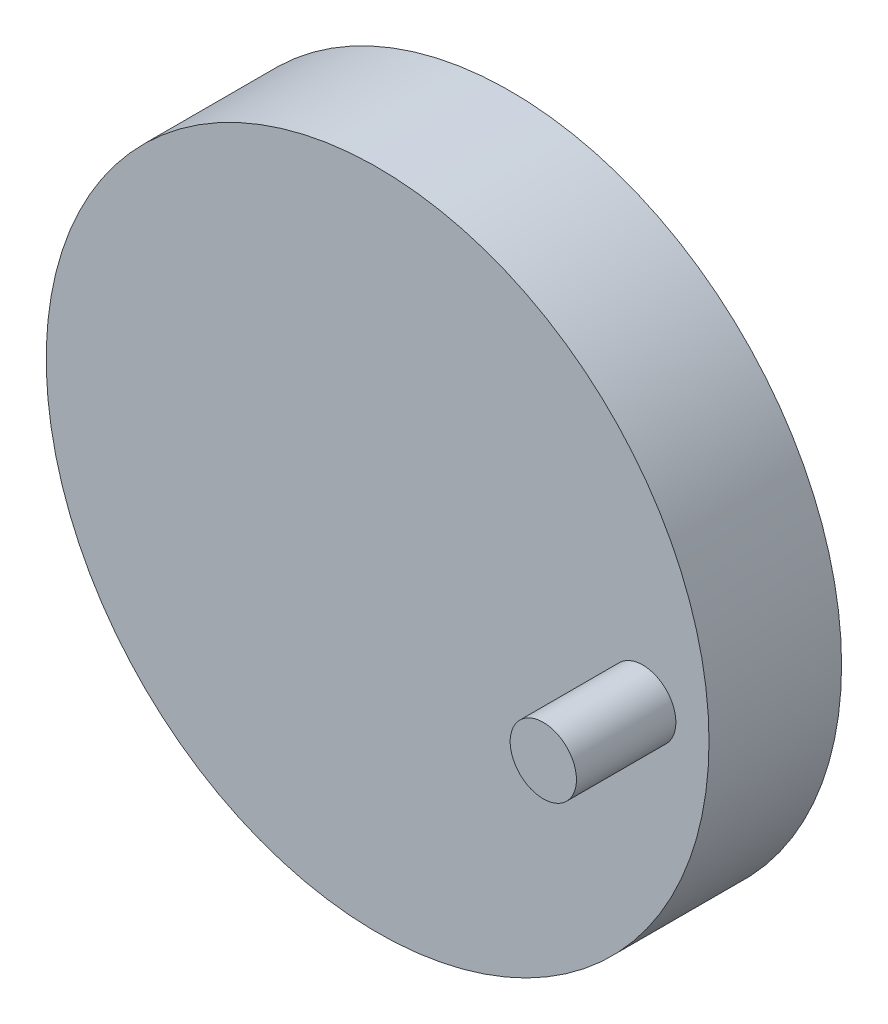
from build123d import *

# Parameters (mm, degrees)
SKETCH2_R           = 50
BOSS_EXTRUDE1_DEPTH = 20
SKETCH3_R           = 10
BOSS_EXTRUDE2_DEPTH = 20
SKETCH4_R           = 5
BOSS_EXTRUDE3_DEPTH = 35


with BuildPart() as part:
    # Sketch2 → Boss-Extrude1 (new body)
    with BuildSketch(Plane.XY):
        Circle(SKETCH2_R)
    extrude(amount=BOSS_EXTRUDE1_DEPTH)

    # Sketch3 → Boss-Extrude2 (add)
    with BuildSketch(Plane.XY):
        Circle(SKETCH3_R)
    extrude(amount=-BOSS_EXTRUDE2_DEPTH)

    # Sketch4 → Boss-Extrude3 (add)
    with BuildSketch(Plane.XY):
        with Locations((40, 0)):
            Circle(SKETCH4_R)
    extrude(amount=BOSS_EXTRUDE3_DEPTH)


solid = part.part
